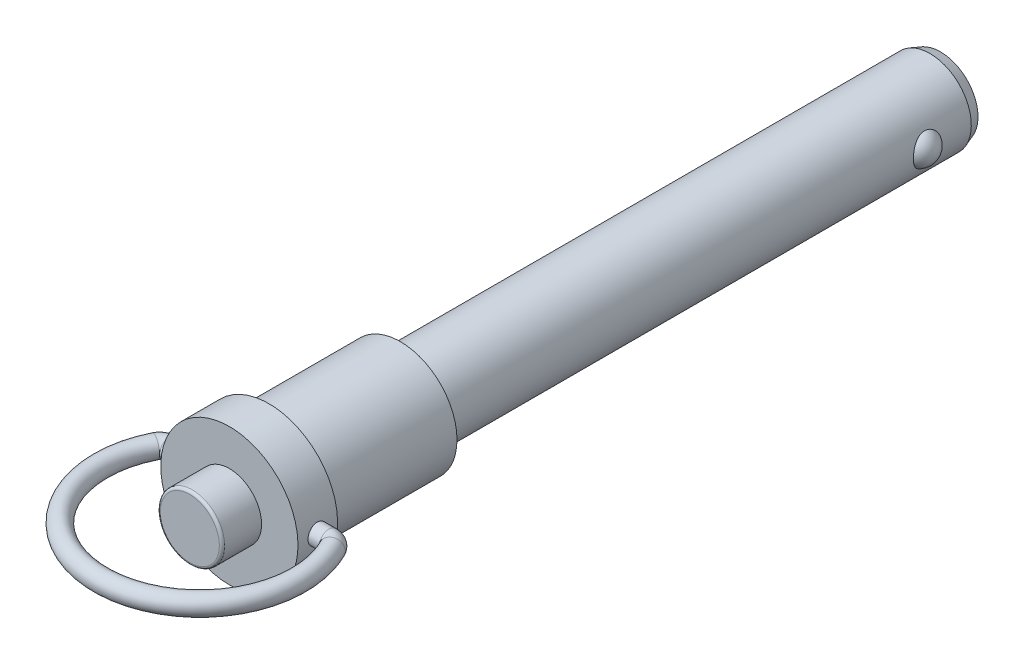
ISO-10303-21;
HEADER;
FILE_DESCRIPTION(('STEP AP214'),'2;1');
FILE_NAME('part.step','',(''),(''),'','','');
FILE_SCHEMA(('AUTOMOTIVE_DESIGN { 1 0 10303 214 1 1 1 1 }'));
ENDSEC;
DATA;
#1=APPLICATION_CONTEXT('core data for automotive mechanical design processes');
#2=APPLICATION_PROTOCOL_DEFINITION('international standard','automotive_design',2000,#1);
#3=PRODUCT_CONTEXT('',#1,'mechanical');
#4=PRODUCT('Part','Part','',(#3));
#5=PRODUCT_RELATED_PRODUCT_CATEGORY('part','',(#4));
#6=PRODUCT_DEFINITION_FORMATION('','',#4);
#7=PRODUCT_DEFINITION_CONTEXT('part definition',#1,'design');
#8=PRODUCT_DEFINITION('design','',#6,#7);
#9=PRODUCT_DEFINITION_SHAPE('','',#8);
#10=(LENGTH_UNIT() NAMED_UNIT(*) SI_UNIT(.MILLI.,.METRE.));
#11=(NAMED_UNIT(*) PLANE_ANGLE_UNIT() SI_UNIT($,.RADIAN.));
#12=(NAMED_UNIT(*) SI_UNIT($,.STERADIAN.) SOLID_ANGLE_UNIT());
#13=UNCERTAINTY_MEASURE_WITH_UNIT(LENGTH_MEASURE(1.E-05),#10,'distance_accuracy_value','');
#14=(GEOMETRIC_REPRESENTATION_CONTEXT(3) GLOBAL_UNCERTAINTY_ASSIGNED_CONTEXT((#13)) GLOBAL_UNIT_ASSIGNED_CONTEXT((#10,
#11,#12)) REPRESENTATION_CONTEXT('',''));
#15=CARTESIAN_POINT('',(0.,0.,0.));
#16=DIRECTION('',(0.,0.,1.));
#17=DIRECTION('',(1.,0.,0.));
#18=AXIS2_PLACEMENT_3D('',#15,#16,#17);
#19=CARTESIAN_POINT('',(-7.23283748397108,0.,-103.9826));
#20=DIRECTION('',(0.,0.,1.));
#21=DIRECTION('',(0.,1.,0.));
#22=AXIS2_PLACEMENT_3D('',#19,#20,#21);
#23=PLANE('',#22);
#24=CARTESIAN_POINT('',(0.,0.,-103.9826));
#25=DIRECTION('',(0.,0.,1.));
#26=DIRECTION('',(0.,1.,0.));
#27=AXIS2_PLACEMENT_3D('',#24,#25,#26);
#28=CIRCLE('',#27,7.23283748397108);
#29=CARTESIAN_POINT('',(0.,7.23283748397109,-103.9826));
#30=VERTEX_POINT('',#29);
#31=EDGE_CURVE('E228',#30,#30,#28,.T.);
#32=ORIENTED_EDGE('',*,*,#31,.F.);
#33=EDGE_LOOP('',(#32));
#34=FACE_BOUND('',#33,.T.);
#35=ADVANCED_FACE('F14',(#34),#23,.F.);
#36=CARTESIAN_POINT('',(6.3254,0.,-93.5178));
#37=DIRECTION('',(0.,0.,1.));
#38=DIRECTION('',(-1.,0.,0.));
#39=AXIS2_PLACEMENT_3D('',#36,#37,#38);
#40=SPHERICAL_SURFACE('',#39,3.175);
#41=CARTESIAN_POINT('',(7.972425,0.,-90.8034062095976));
#42=CARTESIAN_POINT('',(7.97241726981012,0.174963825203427,-90.8034110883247));
#43=CARTESIAN_POINT('',(7.96661031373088,0.350072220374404,-90.8168531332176));
#44=CARTESIAN_POINT('',(7.94391651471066,0.695574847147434,-90.8705412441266));
#45=CARTESIAN_POINT('',(7.92701418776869,0.865962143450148,-90.9108247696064));
#46=CARTESIAN_POINT('',(7.88381094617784,1.19705751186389,-91.0178494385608));
#47=CARTESIAN_POINT('',(7.85750751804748,1.35776298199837,-91.084597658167));
#48=CARTESIAN_POINT('',(7.79828591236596,1.66454963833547,-91.2437588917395));
#49=CARTESIAN_POINT('',(7.7653692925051,1.81063425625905,-91.3361658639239));
#50=CARTESIAN_POINT('',(7.6973220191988,2.08082133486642,-91.5434318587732));
#51=CARTESIAN_POINT('',(7.66224767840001,2.20529978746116,-91.6578132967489));
#52=CARTESIAN_POINT('',(7.61082801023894,2.37452550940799,-91.8452714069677));
#53=CARTESIAN_POINT('',(7.59387880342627,2.42804053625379,-91.9104406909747));
#54=CARTESIAN_POINT('',(7.56094914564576,2.52871559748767,-92.045725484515));
#55=CARTESIAN_POINT('',(7.54496815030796,2.57587922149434,-92.115838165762));
#56=CARTESIAN_POINT('',(7.51569590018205,2.66002101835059,-92.2550958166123));
#57=CARTESIAN_POINT('',(7.50229271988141,2.69749875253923,-92.3239160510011));
#58=CARTESIAN_POINT('',(7.47725403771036,2.76614659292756,-92.4649044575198));
#59=CARTESIAN_POINT('',(7.46561758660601,2.79732008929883,-92.5370708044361));
#60=CARTESIAN_POINT('',(7.44451748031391,2.85299970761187,-92.6841997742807));
#61=CARTESIAN_POINT('',(7.43505273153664,2.87750918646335,-92.7591609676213));
#62=CARTESIAN_POINT('',(7.41863811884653,2.91956849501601,-92.9112788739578));
#63=CARTESIAN_POINT('',(7.41168797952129,2.93711908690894,-92.9884353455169));
#64=CARTESIAN_POINT('',(7.40116212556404,2.96353478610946,-93.1359046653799));
#65=CARTESIAN_POINT('',(7.39730521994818,2.97312751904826,-93.2060679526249));
#66=CARTESIAN_POINT('',(7.39192783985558,2.98647205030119,-93.3470623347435));
#67=CARTESIAN_POINT('',(7.39040812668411,2.99022194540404,-93.4178936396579));
#68=CARTESIAN_POINT('',(7.38975833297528,2.99182794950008,-93.5595897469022));
#69=CARTESIAN_POINT('',(7.39062662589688,2.98968807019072,-93.6304544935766));
#70=CARTESIAN_POINT('',(7.39471686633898,2.97955470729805,-93.7717034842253));
#71=CARTESIAN_POINT('',(7.39793967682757,2.97155907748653,-93.8420875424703));
#72=CARTESIAN_POINT('',(7.41052697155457,2.94009947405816,-94.043919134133));
#73=CARTESIAN_POINT('',(7.42280379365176,2.90920494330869,-94.1741115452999));
#74=CARTESIAN_POINT('',(7.4541314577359,2.82795803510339,-94.4273054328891));
#75=CARTESIAN_POINT('',(7.47318306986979,2.7776034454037,-94.5503060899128));
#76=CARTESIAN_POINT('',(7.51696016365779,2.65690222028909,-94.7909708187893));
#77=CARTESIAN_POINT('',(7.5418730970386,2.58587106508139,-94.9082567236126));
#78=CARTESIAN_POINT('',(7.59450635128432,2.426938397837,-95.1300314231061));
#79=CARTESIAN_POINT('',(7.62222751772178,2.33903179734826,-95.234516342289));
#80=CARTESIAN_POINT('',(7.68069620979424,2.13967899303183,-95.4383986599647));
#81=CARTESIAN_POINT('',(7.71148158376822,2.0267915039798,-95.5363756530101));
#82=CARTESIAN_POINT('',(7.77061509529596,1.78672707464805,-95.7138815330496));
#83=CARTESIAN_POINT('',(7.79896157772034,1.65954056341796,-95.7933979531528));
#84=CARTESIAN_POINT('',(7.85313577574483,1.38188004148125,-95.9395063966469));
#85=CARTESIAN_POINT('',(7.87849512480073,1.23034006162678,-96.0042480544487));
#86=CARTESIAN_POINT('',(7.92093083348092,0.918236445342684,-96.1099613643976));
#87=CARTESIAN_POINT('',(7.9380155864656,0.757682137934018,-96.1509571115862));
#88=CARTESIAN_POINT('',(7.95754077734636,0.496793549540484,-96.1973352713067));
#89=CARTESIAN_POINT('',(7.96310427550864,0.397984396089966,-96.2104005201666));
#90=CARTESIAN_POINT('',(7.97054862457,0.199465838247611,-96.2278312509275));
#91=CARTESIAN_POINT('',(7.97242940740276,0.0997564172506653,-96.2321965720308));
#92=CARTESIAN_POINT('',(7.97241726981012,-0.174963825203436,-96.2321889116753));
#93=CARTESIAN_POINT('',(7.96661031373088,-0.350072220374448,-96.2187468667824));
#94=CARTESIAN_POINT('',(7.94391651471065,-0.695574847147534,-96.1650587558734));
#95=CARTESIAN_POINT('',(7.92701418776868,-0.865962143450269,-96.1247752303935));
#96=CARTESIAN_POINT('',(7.88381094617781,-1.19705751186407,-96.0177505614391));
#97=CARTESIAN_POINT('',(7.85750751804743,-1.35776298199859,-95.9510023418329));
#98=CARTESIAN_POINT('',(7.79828591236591,-1.66454963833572,-95.7918411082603));
#99=CARTESIAN_POINT('',(7.76536929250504,-1.8106342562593,-95.6994341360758));
#100=CARTESIAN_POINT('',(7.69732201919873,-2.08082133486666,-95.4921681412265));
#101=CARTESIAN_POINT('',(7.66224767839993,-2.20529978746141,-95.3777867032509));
#102=CARTESIAN_POINT('',(7.61082801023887,-2.37452550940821,-95.190328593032));
#103=CARTESIAN_POINT('',(7.5938788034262,-2.42804053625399,-95.125159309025));
#104=CARTESIAN_POINT('',(7.5609491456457,-2.52871559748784,-94.9898745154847));
#105=CARTESIAN_POINT('',(7.54496815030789,-2.57587922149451,-94.9197618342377));
#106=CARTESIAN_POINT('',(7.51569590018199,-2.66002101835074,-94.7805041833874));
#107=CARTESIAN_POINT('',(7.50229271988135,-2.69749875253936,-94.7116839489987));
#108=CARTESIAN_POINT('',(7.47725403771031,-2.76614659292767,-94.5706955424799));
#109=CARTESIAN_POINT('',(7.46561758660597,-2.79732008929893,-94.4985291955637));
#110=CARTESIAN_POINT('',(7.44451748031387,-2.85299970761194,-94.351400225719));
#111=CARTESIAN_POINT('',(7.43505273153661,-2.87750918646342,-94.2764390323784));
#112=CARTESIAN_POINT('',(7.41863811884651,-2.91956849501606,-94.1243211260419));
#113=CARTESIAN_POINT('',(7.41168797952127,-2.93711908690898,-94.0471646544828));
#114=CARTESIAN_POINT('',(7.40116212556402,-2.96353478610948,-93.8996953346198));
#115=CARTESIAN_POINT('',(7.39730521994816,-2.97312751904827,-93.8295320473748));
#116=CARTESIAN_POINT('',(7.39192783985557,-2.98647205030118,-93.6885376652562));
#117=CARTESIAN_POINT('',(7.3904081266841,-2.99022194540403,-93.6177063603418));
#118=CARTESIAN_POINT('',(7.38975833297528,-2.99182794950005,-93.4760102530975));
#119=CARTESIAN_POINT('',(7.39062662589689,-2.98968807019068,-93.4051455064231));
#120=CARTESIAN_POINT('',(7.39471686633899,-2.97955470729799,-93.2638965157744));
#121=CARTESIAN_POINT('',(7.39793967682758,-2.97155907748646,-93.1935124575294));
#122=CARTESIAN_POINT('',(7.41052697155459,-2.94009947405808,-92.9916808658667));
#123=CARTESIAN_POINT('',(7.42280379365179,-2.90920494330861,-92.8614884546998));
#124=CARTESIAN_POINT('',(7.45413145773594,-2.82795803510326,-92.6082945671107));
#125=CARTESIAN_POINT('',(7.47318306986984,-2.77760344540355,-92.485293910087));
#126=CARTESIAN_POINT('',(7.51696016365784,-2.65690222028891,-92.2446291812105));
#127=CARTESIAN_POINT('',(7.54187309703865,-2.58587106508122,-92.1273432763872));
#128=CARTESIAN_POINT('',(7.59450635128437,-2.42693839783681,-91.9055685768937));
#129=CARTESIAN_POINT('',(7.62222751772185,-2.33903179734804,-91.8010836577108));
#130=CARTESIAN_POINT('',(7.68069620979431,-2.13967899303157,-91.5972013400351));
#131=CARTESIAN_POINT('',(7.71148158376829,-2.02679150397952,-91.4992243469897));
#132=CARTESIAN_POINT('',(7.77061509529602,-1.78672707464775,-91.3217184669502));
#133=CARTESIAN_POINT('',(7.7989615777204,-1.65954056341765,-91.242202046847));
#134=CARTESIAN_POINT('',(7.85313577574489,-1.38188004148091,-91.0960936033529));
#135=CARTESIAN_POINT('',(7.87849512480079,-1.23034006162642,-91.0313519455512));
#136=CARTESIAN_POINT('',(7.92093083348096,-0.918236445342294,-90.9256386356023));
#137=CARTESIAN_POINT('',(7.93801558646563,-0.757682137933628,-90.8846428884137));
#138=CARTESIAN_POINT('',(7.95754077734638,-0.496793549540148,-90.8382647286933));
#139=CARTESIAN_POINT('',(7.96310427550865,-0.39798439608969,-90.8251994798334));
#140=CARTESIAN_POINT('',(7.97054862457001,-0.199465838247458,-90.8077687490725));
#141=CARTESIAN_POINT('',(7.97242940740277,-0.0997564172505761,-90.8034034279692));
#142=CARTESIAN_POINT('',(7.972425,0.,-90.8034062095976));
#143=B_SPLINE_CURVE_WITH_KNOTS('',3,(#41,#42,#43,#44,#45,#46,#47,#48,#49,#50,#51,#52,#53,#54,
#55,#56,#57,#58,#59,#60,#61,#62,#63,#64,#65,#66,#67,#68,#69,#70,#71,#72,#73,#74,#75,#76,#77,#78,
#79,#80,#81,#82,#83,#84,#85,#86,#87,#88,#89,#90,#91,#92,#93,#94,#95,#96,#97,#98,#99,#100,#101,
#102,#103,#104,#105,#106,#107,#108,#109,#110,#111,#112,#113,#114,#115,#116,#117,#118,#119,#120,
#121,#122,#123,#124,#125,#126,#127,#128,#129,#130,#131,#132,#133,#134,#135,#136,#137,#138,#139,
#140,#141,#142),.UNSPECIFIED.,.T.,.F.,(4,2,2,2,2,2,2,2,2,2,2,2,2,2,2,2,2,2,2,2,2,2,2,2,2,2,2,2,
2,2,2,2,2,2,2,2,2,2,2,2,2,2,2,2,2,2,2,2,2,2,4),(0.,0.52453249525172,1.04979855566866,
1.57520515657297,2.10048814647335,2.61543479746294,2.87315909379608,3.13073711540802,
3.36891793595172,3.60697032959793,3.84490258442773,4.0828087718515,4.29529683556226,
4.5078540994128,4.72026662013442,4.93275703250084,5.33386765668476,5.73502389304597,
6.15136290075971,6.56782764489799,7.02375816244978,7.4799956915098,7.97801301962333,
8.47552411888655,8.77458316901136,9.07364774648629,9.59818024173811,10.1234463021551,
10.6488529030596,11.17413589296,11.6890825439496,11.9468068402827,12.2043848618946,
12.4425656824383,12.6806180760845,12.9185503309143,13.1564565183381,13.3689445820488,
13.5815018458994,13.793914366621,14.0064047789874,14.4075154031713,14.8086716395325,
15.2250106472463,15.6414753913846,16.0974059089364,16.5536434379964,17.05166076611,
17.5491718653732,17.8482309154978,18.1472954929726),.UNSPECIFIED.);
#144=CARTESIAN_POINT('',(7.972425,0.,-90.8034062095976));
#145=VERTEX_POINT('',#144);
#146=EDGE_CURVE('E221',#145,#145,#143,.T.);
#147=ORIENTED_EDGE('',*,*,#146,.F.);
#148=EDGE_LOOP('',(#147));
#149=FACE_BOUND('',#148,.T.);
#150=ADVANCED_FACE('F229',(#149),#40,.T.);
#151=CARTESIAN_POINT('',(-6.3246,0.,-93.5178));
#152=DIRECTION('',(0.,0.,1.));
#153=DIRECTION('',(-1.,0.,0.));
#154=AXIS2_PLACEMENT_3D('',#151,#152,#153);
#155=SPHERICAL_SURFACE('',#154,3.175);
#156=CARTESIAN_POINT('',(-7.972425,0.,-96.2317082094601));
#157=CARTESIAN_POINT('',(-7.97241727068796,0.174952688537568,-96.2317033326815));
#158=CARTESIAN_POINT('',(-7.96661105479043,0.350049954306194,-96.2182623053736));
#159=CARTESIAN_POINT('',(-7.94392013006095,0.695530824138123,-96.1645780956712));
#160=CARTESIAN_POINT('',(-7.92701993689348,0.865907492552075,-96.1242974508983));
#161=CARTESIAN_POINT('',(-7.88382210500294,1.1969825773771,-96.0172798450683));
#162=CARTESIAN_POINT('',(-7.85752194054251,1.35767837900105,-95.950535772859));
#163=CARTESIAN_POINT('',(-7.79830777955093,1.66444625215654,-95.7913834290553));
#164=CARTESIAN_POINT('',(-7.76539534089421,1.81052175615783,-95.6989812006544));
#165=CARTESIAN_POINT('',(-7.69735815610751,2.08068673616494,-95.4917274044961));
#166=CARTESIAN_POINT('',(-7.66228978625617,2.20515274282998,-95.3773541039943));
#167=CARTESIAN_POINT('',(-7.61087967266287,2.37435974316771,-95.1899087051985));
#168=CARTESIAN_POINT('',(-7.593933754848,2.42786851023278,-95.124743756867));
#169=CARTESIAN_POINT('',(-7.5610108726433,2.52853087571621,-94.9894677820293));
#170=CARTESIAN_POINT('',(-7.54503336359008,2.57568806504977,-94.9193595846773));
#171=CARTESIAN_POINT('',(-7.515769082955,2.6598140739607,-94.7801158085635));
#172=CARTESIAN_POINT('',(-7.5023702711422,2.69728292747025,-94.7113052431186));
#173=CARTESIAN_POINT('',(-7.47734019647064,2.76591355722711,-94.5703368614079));
#174=CARTESIAN_POINT('',(-7.46570798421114,2.79707872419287,-94.4981808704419));
#175=CARTESIAN_POINT('',(-7.44461613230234,2.85274218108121,-94.3510733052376));
#176=CARTESIAN_POINT('',(-7.43515539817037,2.87724383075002,-94.2761231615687));
#177=CARTESIAN_POINT('',(-7.41874848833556,2.91928796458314,-94.1240280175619));
#178=CARTESIAN_POINT('',(-7.41180203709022,2.9368312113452,-94.0468832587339));
#179=CARTESIAN_POINT('',(-7.40128307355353,2.96323267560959,-93.8994411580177));
#180=CARTESIAN_POINT('',(-7.39742927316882,2.97281883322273,-93.829293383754));
#181=CARTESIAN_POINT('',(-7.3920573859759,2.98615137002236,-93.6883306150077));
#182=CARTESIAN_POINT('',(-7.39054006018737,2.98989584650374,-93.6175154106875));
#183=CARTESIAN_POINT('',(-7.38989424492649,2.99149222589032,-93.4758519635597));
#184=CARTESIAN_POINT('',(-7.39076412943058,2.9893481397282,-93.4050037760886));
#185=CARTESIAN_POINT('',(-7.39485671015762,2.97920762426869,-93.2637882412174));
#186=CARTESIAN_POINT('',(-7.39808026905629,2.97120904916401,-93.1934210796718));
#187=CARTESIAN_POINT('',(-7.41066840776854,2.93974298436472,-92.9916394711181));
#188=CARTESIAN_POINT('',(-7.42294415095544,2.90884676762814,-92.8614803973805));
#189=CARTESIAN_POINT('',(-7.45426659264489,2.82760178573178,-92.6083526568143));
#190=CARTESIAN_POINT('',(-7.4733140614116,2.77725080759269,-92.4853848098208));
#191=CARTESIAN_POINT('',(-7.51708080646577,2.65656071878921,-92.2447817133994));
#192=CARTESIAN_POINT('',(-7.5419875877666,2.58553675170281,-92.1275248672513));
#193=CARTESIAN_POINT('',(-7.59460690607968,2.42662332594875,-91.9058059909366));
#194=CARTESIAN_POINT('',(-7.62232028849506,2.33872877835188,-91.80134783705));
#195=CARTESIAN_POINT('',(-7.68077324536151,2.13940178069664,-91.5975136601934));
#196=CARTESIAN_POINT('',(-7.71155061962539,2.02652778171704,-91.4995584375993));
#197=CARTESIAN_POINT('',(-7.77066832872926,1.78649437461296,-91.3220926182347));
#198=CARTESIAN_POINT('',(-7.79900700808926,1.65932539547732,-91.2425944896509));
#199=CARTESIAN_POINT('',(-7.85316757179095,1.3816977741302,-91.0965158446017));
#200=CARTESIAN_POINT('',(-7.87852090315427,1.23017281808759,-91.0317864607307));
#201=CARTESIAN_POINT('',(-7.92094613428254,0.91810159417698,-90.9260941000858));
#202=CARTESIAN_POINT('',(-7.93802642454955,0.757564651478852,-90.8851070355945));
#203=CARTESIAN_POINT('',(-7.95754577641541,0.496710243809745,-90.8387404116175));
#204=CARTESIAN_POINT('',(-7.96310740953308,0.397917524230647,-90.8256788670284));
#205=CARTESIAN_POINT('',(-7.97054925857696,0.199432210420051,-90.8082530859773));
#206=CARTESIAN_POINT('',(-7.97242940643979,0.0997395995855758,-90.8038890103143));
#207=CARTESIAN_POINT('',(-7.97241727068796,-0.174952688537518,-90.8038966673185));
#208=CARTESIAN_POINT('',(-7.96661105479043,-0.350049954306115,-90.8173376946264));
#209=CARTESIAN_POINT('',(-7.94392013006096,-0.695530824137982,-90.8710219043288));
#210=CARTESIAN_POINT('',(-7.92701993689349,-0.865907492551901,-90.9113025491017));
#211=CARTESIAN_POINT('',(-7.88382210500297,-1.19698257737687,-91.0183201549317));
#212=CARTESIAN_POINT('',(-7.85752194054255,-1.35767837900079,-91.0850642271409));
#213=CARTESIAN_POINT('',(-7.79830777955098,-1.66444625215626,-91.2442165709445));
#214=CARTESIAN_POINT('',(-7.76539534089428,-1.81052175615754,-91.3366187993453));
#215=CARTESIAN_POINT('',(-7.6973581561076,-2.08068673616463,-91.5438725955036));
#216=CARTESIAN_POINT('',(-7.66228978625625,-2.20515274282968,-91.6582458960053));
#217=CARTESIAN_POINT('',(-7.61087967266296,-2.37435974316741,-91.8456912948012));
#218=CARTESIAN_POINT('',(-7.59393375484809,-2.42786851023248,-91.9108562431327));
#219=CARTESIAN_POINT('',(-7.56101087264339,-2.52853087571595,-92.0461322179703));
#220=CARTESIAN_POINT('',(-7.54503336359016,-2.57568806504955,-92.1162404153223));
#221=CARTESIAN_POINT('',(-7.51576908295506,-2.65981407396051,-92.2554841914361));
#222=CARTESIAN_POINT('',(-7.50237027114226,-2.69728292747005,-92.324294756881));
#223=CARTESIAN_POINT('',(-7.47734019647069,-2.76591355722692,-92.4652631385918));
#224=CARTESIAN_POINT('',(-7.4657079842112,-2.7970787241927,-92.5374191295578));
#225=CARTESIAN_POINT('',(-7.44461613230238,-2.85274218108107,-92.6845266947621));
#226=CARTESIAN_POINT('',(-7.4351553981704,-2.87724383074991,-92.7594768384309));
#227=CARTESIAN_POINT('',(-7.41874848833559,-2.91928796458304,-92.9115719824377));
#228=CARTESIAN_POINT('',(-7.41180203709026,-2.9368312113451,-92.9887167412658));
#229=CARTESIAN_POINT('',(-7.40128307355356,-2.96323267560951,-93.136158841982));
#230=CARTESIAN_POINT('',(-7.39742927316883,-2.97281883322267,-93.2063066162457));
#231=CARTESIAN_POINT('',(-7.3920573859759,-2.98615137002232,-93.347269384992));
#232=CARTESIAN_POINT('',(-7.39054006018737,-2.98989584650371,-93.4180845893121));
#233=CARTESIAN_POINT('',(-7.38989424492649,-2.99149222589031,-93.55974803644));
#234=CARTESIAN_POINT('',(-7.39076412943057,-2.98934813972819,-93.6305962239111));
#235=CARTESIAN_POINT('',(-7.3948567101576,-2.9792076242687,-93.7718117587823));
#236=CARTESIAN_POINT('',(-7.39808026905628,-2.97120904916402,-93.8421789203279));
#237=CARTESIAN_POINT('',(-7.41066840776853,-2.93974298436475,-94.0439605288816));
#238=CARTESIAN_POINT('',(-7.42294415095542,-2.90884676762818,-94.1741196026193));
#239=CARTESIAN_POINT('',(-7.45426659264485,-2.82760178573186,-94.4272473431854));
#240=CARTESIAN_POINT('',(-7.47331406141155,-2.77725080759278,-94.550215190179));
#241=CARTESIAN_POINT('',(-7.51708080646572,-2.65656071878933,-94.7908182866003));
#242=CARTESIAN_POINT('',(-7.54198758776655,-2.58553675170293,-94.9080751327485));
#243=CARTESIAN_POINT('',(-7.59460690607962,-2.42662332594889,-95.1297940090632));
#244=CARTESIAN_POINT('',(-7.62232028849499,-2.33872877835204,-95.2342521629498));
#245=CARTESIAN_POINT('',(-7.68077324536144,-2.13940178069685,-95.4380863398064));
#246=CARTESIAN_POINT('',(-7.71155061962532,-2.02652778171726,-95.5360415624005));
#247=CARTESIAN_POINT('',(-7.7706683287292,-1.78649437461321,-95.7135073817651));
#248=CARTESIAN_POINT('',(-7.7990070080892,-1.65932539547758,-95.7930055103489));
#249=CARTESIAN_POINT('',(-7.8531675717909,-1.38169777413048,-95.9390841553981));
#250=CARTESIAN_POINT('',(-7.87852090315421,-1.2301728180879,-96.0038135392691));
#251=CARTESIAN_POINT('',(-7.9209461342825,-0.918101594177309,-96.1095058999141));
#252=CARTESIAN_POINT('',(-7.93802642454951,-0.757564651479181,-96.1504929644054));
#253=CARTESIAN_POINT('',(-7.95754577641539,-0.496710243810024,-96.1968595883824));
#254=CARTESIAN_POINT('',(-7.96310740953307,-0.39791752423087,-96.2099211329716));
#255=CARTESIAN_POINT('',(-7.97054925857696,-0.199432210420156,-96.2273469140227));
#256=CARTESIAN_POINT('',(-7.97242940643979,-0.0997395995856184,-96.2317109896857));
#257=CARTESIAN_POINT('',(-7.972425,0.,-96.2317082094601));
#258=B_SPLINE_CURVE_WITH_KNOTS('',3,(#156,#157,#158,#159,#160,#161,#162,#163,#164,#165,#166,
#167,#168,#169,#170,#171,#172,#173,#174,#175,#176,#177,#178,#179,#180,#181,#182,#183,#184,#185,
#186,#187,#188,#189,#190,#191,#192,#193,#194,#195,#196,#197,#198,#199,#200,#201,#202,#203,#204,
#205,#206,#207,#208,#209,#210,#211,#212,#213,#214,#215,#216,#217,#218,#219,#220,#221,#222,#223,
#224,#225,#226,#227,#228,#229,#230,#231,#232,#233,#234,#235,#236,#237,#238,#239,#240,#241,#242,
#243,#244,#245,#246,#247,#248,#249,#250,#251,#252,#253,#254,#255,#256,#257),.UNSPECIFIED.,.T.,
.F.,(4,2,2,2,2,2,2,2,2,2,2,2,2,2,2,2,2,2,2,2,2,2,2,2,2,2,2,2,2,2,2,2,2,2,2,2,2,2,2,2,2,2,2,2,2,
2,2,2,2,2,4),(0.,0.524499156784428,1.04973194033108,1.57510595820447,2.10035634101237,
2.615256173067,2.87295695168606,3.13051142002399,3.36865238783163,3.60666491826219,
3.84455721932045,4.08242344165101,4.29486234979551,4.50737043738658,4.71973381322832,
4.93217506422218,5.33319020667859,5.73425097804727,6.15050279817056,6.5668803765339,
7.02273464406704,7.47889596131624,7.97685568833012,8.47430932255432,8.77331798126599,
9.07233216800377,9.5968313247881,10.1220641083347,10.6474381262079,11.1726885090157,
11.6875883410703,11.9452891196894,12.2028435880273,12.440984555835,12.6789970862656,
12.9168893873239,13.1547556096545,13.367194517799,13.57970260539,13.7920659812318,
14.0045072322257,14.4055223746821,14.8065831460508,15.2228349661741,15.6392125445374,
16.0950668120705,16.5512281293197,17.0491878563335,17.5466414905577,17.8456501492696,
18.1446643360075),.UNSPECIFIED.);
#259=CARTESIAN_POINT('',(-7.972425,0.,-96.2317082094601));
#260=VERTEX_POINT('',#259);
#261=EDGE_CURVE('E25',#260,#260,#258,.T.);
#262=ORIENTED_EDGE('',*,*,#261,.F.);
#263=EDGE_LOOP('',(#262));
#264=FACE_BOUND('',#263,.T.);
#265=ADVANCED_FACE('F209',(#264),#155,.T.);
#266=CARTESIAN_POINT('',(0.,0.,-101.9506));
#267=DIRECTION('',(0.,0.,1.));
#268=DIRECTION('',(0.,1.,0.));
#269=AXIS2_PLACEMENT_3D('',#266,#267,#268);
#270=CONICAL_SURFACE('',#269,7.972425,0.349065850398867);
#271=CARTESIAN_POINT('',(0.,0.,-101.9506));
#272=DIRECTION('',(0.,0.,1.));
#273=DIRECTION('',(0.,1.,0.));
#274=AXIS2_PLACEMENT_3D('',#271,#272,#273);
#275=CIRCLE('',#274,7.972425);
#276=CARTESIAN_POINT('',(0.,7.97242500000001,-101.9506));
#277=VERTEX_POINT('',#276);
#278=EDGE_CURVE('E9',#277,#277,#275,.T.);
#279=ORIENTED_EDGE('',*,*,#278,.F.);
#280=EDGE_LOOP('',(#279));
#281=FACE_BOUND('',#280,.T.);
#282=ORIENTED_EDGE('',*,*,#31,.T.);
#283=EDGE_LOOP('',(#282));
#284=FACE_BOUND('',#283,.T.);
#285=ADVANCED_FACE('F203',(#281,#284),#270,.T.);
#286=CARTESIAN_POINT('',(0.,0.,-40.));
#287=DIRECTION('',(0.,0.,1.));
#288=DIRECTION('',(0.,1.,0.));
#289=AXIS2_PLACEMENT_3D('',#286,#287,#288);
#290=CYLINDRICAL_SURFACE('',#289,7.972425);
#291=ORIENTED_EDGE('',*,*,#278,.T.);
#292=EDGE_LOOP('',(#291));
#293=FACE_BOUND('',#292,.T.);
#294=ORIENTED_EDGE('',*,*,#261,.T.);
#295=EDGE_LOOP('',(#294));
#296=FACE_BOUND('',#295,.T.);
#297=ORIENTED_EDGE('',*,*,#146,.T.);
#298=EDGE_LOOP('',(#297));
#299=FACE_BOUND('',#298,.T.);
#300=CARTESIAN_POINT('',(0.,0.,0.));
#301=DIRECTION('',(0.,0.,-1.));
#302=DIRECTION('',(0.,1.,0.));
#303=AXIS2_PLACEMENT_3D('',#300,#301,#302);
#304=CIRCLE('',#303,7.972425);
#305=CARTESIAN_POINT('',(0.,7.972425,0.));
#306=VERTEX_POINT('',#305);
#307=EDGE_CURVE('E239',#306,#306,#304,.F.);
#308=ORIENTED_EDGE('',*,*,#307,.F.);
#309=EDGE_LOOP('',(#308));
#310=FACE_BOUND('',#309,.T.);
#311=ADVANCED_FACE('F63',(#293,#296,#299,#310),#290,.T.);
#312=CARTESIAN_POINT('',(0.,0.,40.545));
#313=DIRECTION('',(0.,0.,1.));
#314=DIRECTION('',(0.,1.,0.));
#315=AXIS2_PLACEMENT_3D('',#312,#313,#314);
#316=PLANE('',#315);
#317=CARTESIAN_POINT('',(0.,0.,40.545));
#318=DIRECTION('',(0.,0.,-1.));
#319=DIRECTION('',(0.,-1.,0.));
#320=AXIS2_PLACEMENT_3D('',#317,#318,#319);
#321=CIRCLE('',#320,5.6896);
#322=CARTESIAN_POINT('',(0.,-5.6896,40.545));
#323=VERTEX_POINT('',#322);
#324=CARTESIAN_POINT('',(0.,5.6896,40.545));
#325=VERTEX_POINT('',#324);
#326=EDGE_CURVE('E38',#323,#325,#321,.T.);
#327=ORIENTED_EDGE('',*,*,#326,.F.);
#328=CARTESIAN_POINT('',(0.,0.,40.545));
#329=DIRECTION('',(0.,0.,-1.));
#330=DIRECTION('',(0.,1.,0.));
#331=AXIS2_PLACEMENT_3D('',#328,#329,#330);
#332=CIRCLE('',#331,5.6896);
#333=EDGE_CURVE('E32',#325,#323,#332,.T.);
#334=ORIENTED_EDGE('',*,*,#333,.F.);
#335=EDGE_LOOP('',(#327,#334));
#336=FACE_BOUND('',#335,.T.);
#337=ADVANCED_FACE('F43',(#336),#316,.T.);
#338=CARTESIAN_POINT('',(0.,0.,38.64));
#339=DIRECTION('',(0.,1.,0.));
#340=DIRECTION('',(-1.,0.,0.));
#341=AXIS2_PLACEMENT_3D('',#338,#339,#340);
#342=TOROIDAL_SURFACE('',#341,19.05,1.8796);
#343=CARTESIAN_POINT('',(-17.0651122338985,0.,30.1733333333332));
#344=DIRECTION('',(-0.44444444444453,0.,0.895806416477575));
#345=DIRECTION('',(-0.895806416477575,0.,-0.44444444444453));
#346=AXIS2_PLACEMENT_3D('',#343,#344,#345);
#347=CIRCLE('',#346,1.8796);
#348=CARTESIAN_POINT('',(-18.7488699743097,0.,29.3379555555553));
#349=VERTEX_POINT('',#348);
#350=EDGE_CURVE('E107',#349,#349,#347,.F.);
#351=ORIENTED_EDGE('',*,*,#350,.F.);
#352=EDGE_LOOP('',(#351));
#353=FACE_BOUND('',#352,.T.);
#354=CARTESIAN_POINT('',(17.0651122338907,0.,30.1733333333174));
#355=DIRECTION('',(-0.444444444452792,0.,-0.895806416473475));
#356=DIRECTION('',(0.895806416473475,0.,-0.444444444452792));
#357=AXIS2_PLACEMENT_3D('',#354,#355,#356);
#358=CIRCLE('',#357,1.8796);
#359=CARTESIAN_POINT('',(18.7488699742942,0.,29.3379555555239));
#360=VERTEX_POINT('',#359);
#361=EDGE_CURVE('E104',#360,#360,#358,.T.);
#362=ORIENTED_EDGE('',*,*,#361,.F.);
#363=EDGE_LOOP('',(#362));
#364=FACE_BOUND('',#363,.T.);
#365=ADVANCED_FACE('F62',(#353,#364),#342,.T.);
#366=CARTESIAN_POINT('',(0.,0.,40.037));
#367=DIRECTION('',(0.,0.,1.));
#368=DIRECTION('',(0.,1.,0.));
#369=AXIS2_PLACEMENT_3D('',#366,#367,#368);
#370=TOROIDAL_SURFACE('',#369,5.6896,0.508);
#371=ORIENTED_EDGE('',*,*,#333,.T.);
#372=ORIENTED_EDGE('',*,*,#326,.T.);
#373=EDGE_LOOP('',(#371,#372));
#374=FACE_BOUND('',#373,.T.);
#375=CARTESIAN_POINT('',(0.,0.,40.037));
#376=DIRECTION('',(0.,0.,-1.));
#377=DIRECTION('',(0.,-1.,0.));
#378=AXIS2_PLACEMENT_3D('',#375,#376,#377);
#379=CIRCLE('',#378,6.1976);
#380=CARTESIAN_POINT('',(0.,-6.1976,40.037));
#381=VERTEX_POINT('',#380);
#382=EDGE_CURVE('E81',#381,#381,#379,.T.);
#383=ORIENTED_EDGE('',*,*,#382,.F.);
#384=EDGE_LOOP('',(#383));
#385=FACE_BOUND('',#384,.T.);
#386=ADVANCED_FACE('F36',(#374,#385),#370,.T.);
#387=CARTESIAN_POINT('',(-15.3586010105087,0.,31.02));
#388=DIRECTION('',(0.,1.,0.));
#389=DIRECTION('',(-1.,0.,0.));
#390=AXIS2_PLACEMENT_3D('',#387,#388,#389);
#391=TOROIDAL_SURFACE('',#390,1.905,1.8796);
#392=CARTESIAN_POINT('',(-15.3586010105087,0.,29.115));
#393=DIRECTION('',(1.,0.,0.));
#394=DIRECTION('',(0.,0.,-1.));
#395=AXIS2_PLACEMENT_3D('',#392,#393,#394);
#396=CIRCLE('',#395,1.8796);
#397=CARTESIAN_POINT('',(-15.3586010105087,0.,27.2354));
#398=VERTEX_POINT('',#397);
#399=EDGE_CURVE('E40',#398,#398,#396,.T.);
#400=ORIENTED_EDGE('',*,*,#399,.F.);
#401=EDGE_LOOP('',(#400));
#402=FACE_BOUND('',#401,.T.);
#403=ORIENTED_EDGE('',*,*,#350,.T.);
#404=EDGE_LOOP('',(#403));
#405=FACE_BOUND('',#404,.T.);
#406=ADVANCED_FACE('F64',(#402,#405),#391,.T.);
#407=CARTESIAN_POINT('',(15.3586010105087,0.,31.02));
#408=DIRECTION('',(0.,1.,0.));
#409=DIRECTION('',(-1.,0.,0.));
#410=AXIS2_PLACEMENT_3D('',#407,#408,#409);
#411=TOROIDAL_SURFACE('',#410,1.90500000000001,1.8796);
#412=CARTESIAN_POINT('',(15.3586010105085,0.,29.115));
#413=DIRECTION('',(1.,0.,0.));
#414=DIRECTION('',(0.,0.,-1.));
#415=AXIS2_PLACEMENT_3D('',#412,#413,#414);
#416=CIRCLE('',#415,1.8796);
#417=CARTESIAN_POINT('',(15.3586010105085,0.,27.2354));
#418=VERTEX_POINT('',#417);
#419=EDGE_CURVE('E44',#418,#418,#416,.F.);
#420=ORIENTED_EDGE('',*,*,#419,.F.);
#421=EDGE_LOOP('',(#420));
#422=FACE_BOUND('',#421,.T.);
#423=ORIENTED_EDGE('',*,*,#361,.T.);
#424=EDGE_LOOP('',(#423));
#425=FACE_BOUND('',#424,.T.);
#426=ADVANCED_FACE('F66',(#422,#425),#411,.T.);
#427=CARTESIAN_POINT('',(0.,0.,40.545));
#428=DIRECTION('',(0.,0.,-1.));
#429=DIRECTION('',(0.,-1.,0.));
#430=AXIS2_PLACEMENT_3D('',#427,#428,#429);
#431=CYLINDRICAL_SURFACE('',#430,6.1976);
#432=CARTESIAN_POINT('',(0.,0.,32.925));
#433=DIRECTION('',(0.,0.,-1.));
#434=DIRECTION('',(0.,-1.,0.));
#435=AXIS2_PLACEMENT_3D('',#432,#433,#434);
#436=CIRCLE('',#435,6.1976);
#437=CARTESIAN_POINT('',(0.,-6.1976,32.925));
#438=VERTEX_POINT('',#437);
#439=EDGE_CURVE('E117',#438,#438,#436,.T.);
#440=ORIENTED_EDGE('',*,*,#439,.F.);
#441=EDGE_LOOP('',(#440));
#442=FACE_BOUND('',#441,.T.);
#443=ORIENTED_EDGE('',*,*,#382,.T.);
#444=EDGE_LOOP('',(#443));
#445=FACE_BOUND('',#444,.T.);
#446=ADVANCED_FACE('F86',(#442,#445),#431,.T.);
#447=CARTESIAN_POINT('',(-15.3586010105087,0.,29.115));
#448=DIRECTION('',(1.,0.,0.));
#449=DIRECTION('',(0.,0.,-1.));
#450=AXIS2_PLACEMENT_3D('',#447,#448,#449);
#451=CYLINDRICAL_SURFACE('',#450,1.8796);
#452=CARTESIAN_POINT('',(-13.208,0.,27.2354));
#453=CARTESIAN_POINT('',(-13.2079983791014,0.105008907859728,27.235404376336));
#454=CARTESIAN_POINT('',(-13.2067345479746,0.210080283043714,27.2442296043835));
#455=CARTESIAN_POINT('',(-13.2018144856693,0.41729041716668,27.2792908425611));
#456=CARTESIAN_POINT('',(-13.1981558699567,0.519426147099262,27.3055442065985));
#457=CARTESIAN_POINT('',(-13.1888577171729,0.7177359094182,27.3746649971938));
#458=CARTESIAN_POINT('',(-13.1832196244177,0.813914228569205,27.4175203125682));
#459=CARTESIAN_POINT('',(-13.1705868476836,0.99769843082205,27.5185998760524));
#460=CARTESIAN_POINT('',(-13.1635923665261,1.08530559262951,27.5768218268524));
#461=CARTESIAN_POINT('',(-13.1489704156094,1.25009506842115,27.7074204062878));
#462=CARTESIAN_POINT('',(-13.1413392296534,1.32720810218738,27.7798840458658));
#463=CARTESIAN_POINT('',(-13.1263333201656,1.46822296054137,27.9367218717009));
#464=CARTESIAN_POINT('',(-13.1189586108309,1.5321240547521,28.0210967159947));
#465=CARTESIAN_POINT('',(-13.1052644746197,1.6451672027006,28.1998226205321));
#466=CARTESIAN_POINT('',(-13.0989498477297,1.69424288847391,28.2942160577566));
#467=CARTESIAN_POINT('',(-13.088141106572,1.77581811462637,28.490010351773));
#468=CARTESIAN_POINT('',(-13.0836469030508,1.80831846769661,28.5914108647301));
#469=CARTESIAN_POINT('',(-13.0770241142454,1.85560673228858,28.7976151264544));
#470=CARTESIAN_POINT('',(-13.0748797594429,1.87051276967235,28.9023912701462));
#471=CARTESIAN_POINT('',(-13.0731514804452,1.88255508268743,29.1129780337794));
#472=CARTESIAN_POINT('',(-13.0735674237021,1.87969227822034,29.2187885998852));
#473=CARTESIAN_POINT('',(-13.0768983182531,1.85637484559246,29.4276098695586));
#474=CARTESIAN_POINT('',(-13.07979464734,1.8360513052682,29.5306355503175));
#475=CARTESIAN_POINT('',(-13.0877308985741,1.77859429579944,29.7317993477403));
#476=CARTESIAN_POINT('',(-13.0927708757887,1.74146039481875,29.8299373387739));
#477=CARTESIAN_POINT('',(-13.1044472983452,1.65129893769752,30.0189415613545));
#478=CARTESIAN_POINT('',(-13.1110893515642,1.59821538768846,30.1097807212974));
#479=CARTESIAN_POINT('',(-13.1252173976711,1.47770141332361,30.281311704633));
#480=CARTESIAN_POINT('',(-13.1327034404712,1.4102701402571,30.3620029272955));
#481=CARTESIAN_POINT('',(-13.1477584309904,1.26225301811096,30.5117076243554));
#482=CARTESIAN_POINT('',(-13.1553275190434,1.18155436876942,30.5806096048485));
#483=CARTESIAN_POINT('',(-13.1696331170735,1.00967896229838,30.7039085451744));
#484=CARTESIAN_POINT('',(-13.1763696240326,0.918502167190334,30.7583054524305));
#485=CARTESIAN_POINT('',(-13.1882570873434,0.728165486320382,30.8510539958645));
#486=CARTESIAN_POINT('',(-13.1934072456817,0.62900161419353,30.8893975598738));
#487=CARTESIAN_POINT('',(-13.2015349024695,0.425552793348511,30.9488568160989));
#488=CARTESIAN_POINT('',(-13.2045125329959,0.321268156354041,30.969973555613));
#489=CARTESIAN_POINT('',(-13.2079422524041,0.111500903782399,30.9942327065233));
#490=CARTESIAN_POINT('',(-13.2084158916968,0.00603636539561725,30.9975284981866));
#491=CARTESIAN_POINT('',(-13.2068427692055,-0.203940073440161,30.9864585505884));
#492=CARTESIAN_POINT('',(-13.2047960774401,-0.308452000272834,30.9720933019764));
#493=CARTESIAN_POINT('',(-13.1984256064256,-0.513095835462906,30.9262365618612));
#494=CARTESIAN_POINT('',(-13.1941116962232,-0.613244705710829,30.894819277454));
#495=CARTESIAN_POINT('',(-13.1836891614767,-0.806853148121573,30.8158281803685));
#496=CARTESIAN_POINT('',(-13.1775804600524,-0.900312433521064,30.768253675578));
#497=CARTESIAN_POINT('',(-13.1641942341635,-1.07856665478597,30.6579350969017));
#498=CARTESIAN_POINT('',(-13.1569092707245,-1.16330041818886,30.5950930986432));
#499=CARTESIAN_POINT('',(-13.1420059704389,-1.32107337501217,30.4561604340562));
#500=CARTESIAN_POINT('',(-13.1343876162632,-1.39411195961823,30.3800690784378));
#501=CARTESIAN_POINT('',(-13.1196084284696,-1.52697484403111,30.2161171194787));
#502=CARTESIAN_POINT('',(-13.1124514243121,-1.58669669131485,30.1281730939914));
#503=CARTESIAN_POINT('',(-13.099471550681,-1.69052011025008,29.9434117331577));
#504=CARTESIAN_POINT('',(-13.0936486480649,-1.73462206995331,29.8465946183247));
#505=CARTESIAN_POINT('',(-13.0840235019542,-1.80579270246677,29.6471490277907));
#506=CARTESIAN_POINT('',(-13.0802147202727,-1.83291654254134,29.5445405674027));
#507=CARTESIAN_POINT('',(-13.0750312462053,-1.86953730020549,29.336166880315));
#508=CARTESIAN_POINT('',(-13.0736564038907,-1.87903530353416,29.2304018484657));
#509=CARTESIAN_POINT('',(-13.0735016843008,-1.88011086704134,29.0197377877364));
#510=CARTESIAN_POINT('',(-13.0746984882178,-1.87184946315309,28.9148395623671));
#511=CARTESIAN_POINT('',(-13.0795017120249,-1.83798448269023,28.7079399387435));
#512=CARTESIAN_POINT('',(-13.0831081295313,-1.81238092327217,28.6059385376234));
#513=CARTESIAN_POINT('',(-13.092316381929,-1.74461326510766,28.4077650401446));
#514=CARTESIAN_POINT('',(-13.0979169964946,-1.70245929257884,28.3115894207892));
#515=CARTESIAN_POINT('',(-13.1104842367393,-1.60280330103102,28.1276498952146));
#516=CARTESIAN_POINT('',(-13.1174508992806,-1.54530086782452,28.0398862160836));
#517=CARTESIAN_POINT('',(-13.1320406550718,-1.41599095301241,27.8744419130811));
#518=CARTESIAN_POINT('',(-13.1396689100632,-1.34406391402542,27.7968551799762));
#519=CARTESIAN_POINT('',(-13.1546784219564,-1.18819878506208,27.6547945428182));
#520=CARTESIAN_POINT('',(-13.1620596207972,-1.10425789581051,27.590323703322));
#521=CARTESIAN_POINT('',(-13.1757845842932,-0.926263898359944,27.4760444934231));
#522=CARTESIAN_POINT('',(-13.1821230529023,-0.832162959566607,27.4263100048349));
#523=CARTESIAN_POINT('',(-13.1929960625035,-0.636900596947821,27.3434245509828));
#524=CARTESIAN_POINT('',(-13.1975325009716,-0.535746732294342,27.3102561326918));
#525=CARTESIAN_POINT('',(-13.2032356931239,-0.361762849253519,27.2691055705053));
#526=CARTESIAN_POINT('',(-13.205013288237,-0.29001488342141,27.2564849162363));
#527=CARTESIAN_POINT('',(-13.2073959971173,-0.145521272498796,27.2396306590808));
#528=CARTESIAN_POINT('',(-13.2080011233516,-0.0727756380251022,27.2353969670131));
#529=CARTESIAN_POINT('',(-13.208,0.,27.2354));
#530=B_SPLINE_CURVE_WITH_KNOTS('',3,(#452,#453,#454,#455,#456,#457,#458,#459,#460,#461,#462,
#463,#464,#465,#466,#467,#468,#469,#470,#471,#472,#473,#474,#475,#476,#477,#478,#479,#480,#481,
#482,#483,#484,#485,#486,#487,#488,#489,#490,#491,#492,#493,#494,#495,#496,#497,#498,#499,#500,
#501,#502,#503,#504,#505,#506,#507,#508,#509,#510,#511,#512,#513,#514,#515,#516,#517,#518,#519,
#520,#521,#522,#523,#524,#525,#526,#527,#528,#529),.UNSPECIFIED.,.T.,.F.,(4,2,2,2,2,2,2,2,2,2,2,
2,2,2,2,2,2,2,2,2,2,2,2,2,2,2,2,2,2,2,2,2,2,2,2,2,2,2,4),(0.,0.314760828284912,
0.629835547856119,0.944680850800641,1.25947911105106,1.57626405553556,1.89306650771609,
2.21126684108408,2.52945157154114,2.84548767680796,3.16150742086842,3.4751751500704,
3.78885093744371,4.10364106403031,4.41844981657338,4.736088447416,5.05372822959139,
5.37152754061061,5.68930752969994,6.00434806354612,6.3193798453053,6.63305153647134,
6.94673666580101,7.26248947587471,7.57825871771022,7.89637938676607,8.21449215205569,
8.53156582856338,8.84861997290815,9.16281131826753,9.4770023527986,9.79100145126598,
10.1050090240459,10.42173562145,10.7385361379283,11.0568990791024,11.3749259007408,
11.5930708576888,11.8112134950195),.UNSPECIFIED.);
#531=CARTESIAN_POINT('',(-13.208,0.,27.2354));
#532=VERTEX_POINT('',#531);
#533=EDGE_CURVE('E186',#532,#532,#530,.T.);
#534=ORIENTED_EDGE('',*,*,#533,.F.);
#535=EDGE_LOOP('',(#534));
#536=FACE_BOUND('',#535,.T.);
#537=ORIENTED_EDGE('',*,*,#399,.T.);
#538=EDGE_LOOP('',(#537));
#539=FACE_BOUND('',#538,.T.);
#540=ADVANCED_FACE('F87',(#536,#539),#451,.T.);
#541=CARTESIAN_POINT('',(-15.3586010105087,0.,29.115));
#542=DIRECTION('',(1.,0.,0.));
#543=DIRECTION('',(0.,0.,-1.));
#544=AXIS2_PLACEMENT_3D('',#541,#542,#543);
#545=CYLINDRICAL_SURFACE('',#544,1.8796);
#546=CARTESIAN_POINT('',(13.208,0.,27.2354));
#547=CARTESIAN_POINT('',(13.2079983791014,-0.105008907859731,27.235404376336));
#548=CARTESIAN_POINT('',(13.2067345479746,-0.210080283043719,27.2442296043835));
#549=CARTESIAN_POINT('',(13.2018144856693,-0.417290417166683,27.2792908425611));
#550=CARTESIAN_POINT('',(13.1981558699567,-0.51942614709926,27.3055442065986));
#551=CARTESIAN_POINT('',(13.1888577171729,-0.717735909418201,27.3746649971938));
#552=CARTESIAN_POINT('',(13.1832196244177,-0.813914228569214,27.4175203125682));
#553=CARTESIAN_POINT('',(13.1705868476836,-0.997698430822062,27.5185998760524));
#554=CARTESIAN_POINT('',(13.1635923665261,-1.08530559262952,27.5768218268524));
#555=CARTESIAN_POINT('',(13.1489704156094,-1.25009506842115,27.7074204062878));
#556=CARTESIAN_POINT('',(13.1413392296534,-1.32720810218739,27.7798840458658));
#557=CARTESIAN_POINT('',(13.1263333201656,-1.46822296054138,27.9367218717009));
#558=CARTESIAN_POINT('',(13.1189586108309,-1.5321240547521,28.0210967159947));
#559=CARTESIAN_POINT('',(13.1052644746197,-1.6451672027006,28.1998226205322));
#560=CARTESIAN_POINT('',(13.0989498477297,-1.69424288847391,28.2942160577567));
#561=CARTESIAN_POINT('',(13.088141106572,-1.77581811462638,28.490010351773));
#562=CARTESIAN_POINT('',(13.0836469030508,-1.80831846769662,28.5914108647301));
#563=CARTESIAN_POINT('',(13.0770241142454,-1.85560673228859,28.7976151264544));
#564=CARTESIAN_POINT('',(13.0748797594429,-1.87051276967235,28.9023912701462));
#565=CARTESIAN_POINT('',(13.0731514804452,-1.88255508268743,29.1129780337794));
#566=CARTESIAN_POINT('',(13.0735674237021,-1.87969227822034,29.2187885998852));
#567=CARTESIAN_POINT('',(13.0768983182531,-1.85637484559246,29.4276098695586));
#568=CARTESIAN_POINT('',(13.07979464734,-1.8360513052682,29.5306355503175));
#569=CARTESIAN_POINT('',(13.0877308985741,-1.77859429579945,29.7317993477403));
#570=CARTESIAN_POINT('',(13.0927708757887,-1.74146039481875,29.8299373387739));
#571=CARTESIAN_POINT('',(13.1044472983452,-1.65129893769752,30.0189415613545));
#572=CARTESIAN_POINT('',(13.1110893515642,-1.59821538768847,30.1097807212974));
#573=CARTESIAN_POINT('',(13.1252173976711,-1.47770141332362,30.281311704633));
#574=CARTESIAN_POINT('',(13.1327034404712,-1.4102701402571,30.3620029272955));
#575=CARTESIAN_POINT('',(13.1477584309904,-1.26225301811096,30.5117076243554));
#576=CARTESIAN_POINT('',(13.1553275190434,-1.18155436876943,30.5806096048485));
#577=CARTESIAN_POINT('',(13.1696331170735,-1.00967896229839,30.7039085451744));
#578=CARTESIAN_POINT('',(13.1763696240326,-0.918502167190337,30.7583054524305));
#579=CARTESIAN_POINT('',(13.1882570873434,-0.728165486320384,30.8510539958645));
#580=CARTESIAN_POINT('',(13.1934072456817,-0.629001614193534,30.8893975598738));
#581=CARTESIAN_POINT('',(13.2015349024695,-0.425552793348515,30.9488568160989));
#582=CARTESIAN_POINT('',(13.2045125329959,-0.321268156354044,30.969973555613));
#583=CARTESIAN_POINT('',(13.2079422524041,-0.111500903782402,30.9942327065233));
#584=CARTESIAN_POINT('',(13.2084158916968,-0.0060363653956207,30.9975284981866));
#585=CARTESIAN_POINT('',(13.2068427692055,0.203940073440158,30.9864585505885));
#586=CARTESIAN_POINT('',(13.2047960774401,0.308452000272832,30.9720933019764));
#587=CARTESIAN_POINT('',(13.1984256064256,0.513095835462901,30.9262365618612));
#588=CARTESIAN_POINT('',(13.1941116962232,0.613244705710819,30.894819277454));
#589=CARTESIAN_POINT('',(13.1836891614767,0.806853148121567,30.8158281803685));
#590=CARTESIAN_POINT('',(13.1775804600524,0.900312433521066,30.7682536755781));
#591=CARTESIAN_POINT('',(13.1641942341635,1.07856665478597,30.6579350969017));
#592=CARTESIAN_POINT('',(13.1569092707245,1.16330041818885,30.5950930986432));
#593=CARTESIAN_POINT('',(13.1420059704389,1.32107337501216,30.4561604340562));
#594=CARTESIAN_POINT('',(13.1343876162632,1.39411195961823,30.3800690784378));
#595=CARTESIAN_POINT('',(13.1196084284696,1.52697484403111,30.2161171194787));
#596=CARTESIAN_POINT('',(13.1124514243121,1.58669669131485,30.1281730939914));
#597=CARTESIAN_POINT('',(13.099471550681,1.69052011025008,29.9434117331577));
#598=CARTESIAN_POINT('',(13.0936486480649,1.73462206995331,29.8465946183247));
#599=CARTESIAN_POINT('',(13.0840235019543,1.80579270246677,29.6471490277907));
#600=CARTESIAN_POINT('',(13.0802147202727,1.83291654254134,29.5445405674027));
#601=CARTESIAN_POINT('',(13.0750312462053,1.86953730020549,29.336166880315));
#602=CARTESIAN_POINT('',(13.0736564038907,1.87903530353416,29.2304018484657));
#603=CARTESIAN_POINT('',(13.0735016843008,1.88011086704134,29.0197377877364));
#604=CARTESIAN_POINT('',(13.0746984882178,1.87184946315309,28.9148395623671));
#605=CARTESIAN_POINT('',(13.0795017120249,1.83798448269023,28.7079399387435));
#606=CARTESIAN_POINT('',(13.0831081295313,1.81238092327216,28.6059385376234));
#607=CARTESIAN_POINT('',(13.092316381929,1.74461326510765,28.4077650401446));
#608=CARTESIAN_POINT('',(13.0979169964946,1.70245929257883,28.3115894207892));
#609=CARTESIAN_POINT('',(13.1104842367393,1.60280330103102,28.1276498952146));
#610=CARTESIAN_POINT('',(13.1174508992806,1.54530086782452,28.0398862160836));
#611=CARTESIAN_POINT('',(13.1320406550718,1.4159909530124,27.8744419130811));
#612=CARTESIAN_POINT('',(13.1396689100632,1.34406391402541,27.7968551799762));
#613=CARTESIAN_POINT('',(13.1546784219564,1.18819878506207,27.6547945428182));
#614=CARTESIAN_POINT('',(13.1620596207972,1.10425789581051,27.590323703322));
#615=CARTESIAN_POINT('',(13.1757845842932,0.926263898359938,27.4760444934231));
#616=CARTESIAN_POINT('',(13.1821230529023,0.832162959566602,27.4263100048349));
#617=CARTESIAN_POINT('',(13.1929960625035,0.636900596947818,27.3434245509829));
#618=CARTESIAN_POINT('',(13.1975325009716,0.535746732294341,27.3102561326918));
#619=CARTESIAN_POINT('',(13.2032356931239,0.361762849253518,27.2691055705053));
#620=CARTESIAN_POINT('',(13.205013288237,0.290014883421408,27.2564849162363));
#621=CARTESIAN_POINT('',(13.2073959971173,0.145521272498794,27.2396306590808));
#622=CARTESIAN_POINT('',(13.2080011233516,0.0727756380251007,27.2353969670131));
#623=CARTESIAN_POINT('',(13.208,0.,27.2354));
#624=B_SPLINE_CURVE_WITH_KNOTS('',3,(#546,#547,#548,#549,#550,#551,#552,#553,#554,#555,#556,
#557,#558,#559,#560,#561,#562,#563,#564,#565,#566,#567,#568,#569,#570,#571,#572,#573,#574,#575,
#576,#577,#578,#579,#580,#581,#582,#583,#584,#585,#586,#587,#588,#589,#590,#591,#592,#593,#594,
#595,#596,#597,#598,#599,#600,#601,#602,#603,#604,#605,#606,#607,#608,#609,#610,#611,#612,#613,
#614,#615,#616,#617,#618,#619,#620,#621,#622,#623),.UNSPECIFIED.,.T.,.F.,(4,2,2,2,2,2,2,2,2,2,2,
2,2,2,2,2,2,2,2,2,2,2,2,2,2,2,2,2,2,2,2,2,2,2,2,2,2,2,4),(0.,0.314760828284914,
0.629835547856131,0.944680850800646,1.25947911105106,1.57626405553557,1.89306650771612,
2.2112668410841,2.52945157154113,2.84548767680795,3.16150742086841,3.47517515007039,
3.7888509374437,4.1036410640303,4.41844981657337,4.73608844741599,5.05372822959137,
5.3715275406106,5.68930752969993,6.0043480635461,6.31937984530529,6.63305153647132,
6.94673666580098,7.2624894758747,7.57825871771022,7.89637938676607,8.21449215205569,
8.53156582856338,8.84861997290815,9.16281131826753,9.4770023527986,9.79100145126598,
10.1050090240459,10.42173562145,10.7385361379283,11.0568990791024,11.3749259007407,
11.5930708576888,11.8112134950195),.UNSPECIFIED.);
#625=CARTESIAN_POINT('',(13.208,0.,27.2354));
#626=VERTEX_POINT('',#625);
#627=EDGE_CURVE('E114',#626,#626,#624,.T.);
#628=ORIENTED_EDGE('',*,*,#627,.F.);
#629=EDGE_LOOP('',(#628));
#630=FACE_BOUND('',#629,.T.);
#631=ORIENTED_EDGE('',*,*,#419,.T.);
#632=EDGE_LOOP('',(#631));
#633=FACE_BOUND('',#632,.T.);
#634=ADVANCED_FACE('F89',(#630,#633),#545,.T.);
#635=CARTESIAN_POINT('',(-13.208,0.,32.925));
#636=DIRECTION('',(0.,0.,1.));
#637=DIRECTION('',(0.,1.,0.));
#638=AXIS2_PLACEMENT_3D('',#635,#636,#637);
#639=PLANE('',#638);
#640=ORIENTED_EDGE('',*,*,#439,.T.);
#641=EDGE_LOOP('',(#640));
#642=FACE_BOUND('',#641,.T.);
#643=CARTESIAN_POINT('',(0.,0.,32.925));
#644=DIRECTION('',(0.,0.,-1.));
#645=DIRECTION('',(0.,-1.,0.));
#646=AXIS2_PLACEMENT_3D('',#643,#644,#645);
#647=CIRCLE('',#646,13.208);
#648=CARTESIAN_POINT('',(0.,-13.208,32.925));
#649=VERTEX_POINT('',#648);
#650=EDGE_CURVE('E115',#649,#649,#647,.T.);
#651=ORIENTED_EDGE('',*,*,#650,.F.);
#652=EDGE_LOOP('',(#651));
#653=FACE_BOUND('',#652,.T.);
#654=ADVANCED_FACE('F145',(#642,#653),#639,.T.);
#655=CARTESIAN_POINT('',(0.,0.,-2.));
#656=DIRECTION('',(0.,0.,-1.));
#657=DIRECTION('',(0.,-1.,0.));
#658=AXIS2_PLACEMENT_3D('',#655,#656,#657);
#659=CYLINDRICAL_SURFACE('',#658,13.208);
#660=CARTESIAN_POINT('',(0.,0.,25.305));
#661=DIRECTION('',(0.,0.,-1.));
#662=DIRECTION('',(0.,-1.,0.));
#663=AXIS2_PLACEMENT_3D('',#660,#661,#662);
#664=CIRCLE('',#663,13.208);
#665=CARTESIAN_POINT('',(0.,-13.208,25.305));
#666=VERTEX_POINT('',#665);
#667=EDGE_CURVE('E111',#666,#666,#664,.T.);
#668=ORIENTED_EDGE('',*,*,#667,.F.);
#669=EDGE_LOOP('',(#668));
#670=FACE_BOUND('',#669,.T.);
#671=ORIENTED_EDGE('',*,*,#650,.T.);
#672=EDGE_LOOP('',(#671));
#673=FACE_BOUND('',#672,.T.);
#674=ORIENTED_EDGE('',*,*,#627,.T.);
#675=EDGE_LOOP('',(#674));
#676=FACE_BOUND('',#675,.T.);
#677=ORIENTED_EDGE('',*,*,#533,.T.);
#678=EDGE_LOOP('',(#677));
#679=FACE_BOUND('',#678,.T.);
#680=ADVANCED_FACE('F158',(#670,#673,#676,#679),#659,.T.);
#681=CARTESIAN_POINT('',(-12.319,0.,25.305));
#682=DIRECTION('',(0.,0.,-1.));
#683=DIRECTION('',(0.,-1.,0.));
#684=AXIS2_PLACEMENT_3D('',#681,#682,#683);
#685=PLANE('',#684);
#686=ORIENTED_EDGE('',*,*,#667,.T.);
#687=EDGE_LOOP('',(#686));
#688=FACE_BOUND('',#687,.T.);
#689=CARTESIAN_POINT('',(0.,0.,25.305));
#690=DIRECTION('',(0.,0.,1.));
#691=DIRECTION('',(1.,0.,0.));
#692=AXIS2_PLACEMENT_3D('',#689,#690,#691);
#693=CIRCLE('',#692,11.3);
#694=CARTESIAN_POINT('',(11.3,0.,25.305));
#695=VERTEX_POINT('',#694);
#696=EDGE_CURVE('E110',#695,#695,#693,.T.);
#697=ORIENTED_EDGE('',*,*,#696,.T.);
#698=EDGE_LOOP('',(#697));
#699=FACE_BOUND('',#698,.T.);
#700=ADVANCED_FACE('F16',(#688,#699),#685,.T.);
#701=CARTESIAN_POINT('',(0.,0.,24.905));
#702=DIRECTION('',(0.,0.,1.));
#703=DIRECTION('',(1.,0.,0.));
#704=AXIS2_PLACEMENT_3D('',#701,#702,#703);
#705=TOROIDAL_SURFACE('',#704,11.3,0.4);
#706=CARTESIAN_POINT('',(0.,0.,24.905));
#707=DIRECTION('',(0.,0.,1.));
#708=DIRECTION('',(1.,0.,0.));
#709=AXIS2_PLACEMENT_3D('',#706,#707,#708);
#710=CIRCLE('',#709,10.9);
#711=CARTESIAN_POINT('',(10.9,0.,24.905));
#712=VERTEX_POINT('',#711);
#713=EDGE_CURVE('E176',#712,#712,#710,.T.);
#714=ORIENTED_EDGE('',*,*,#713,.T.);
#715=EDGE_LOOP('',(#714));
#716=FACE_BOUND('',#715,.T.);
#717=ORIENTED_EDGE('',*,*,#696,.F.);
#718=EDGE_LOOP('',(#717));
#719=FACE_BOUND('',#718,.T.);
#720=ADVANCED_FACE('F147',(#716,#719),#705,.F.);
#721=CARTESIAN_POINT('',(0.,0.,44.4499215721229));
#722=DIRECTION('',(0.,0.,1.));
#723=DIRECTION('',(1.,0.,0.));
#724=AXIS2_PLACEMENT_3D('',#721,#722,#723);
#725=CYLINDRICAL_SURFACE('',#724,10.9);
#726=CARTESIAN_POINT('',(0.,0.,0.));
#727=DIRECTION('',(0.,0.,1.));
#728=DIRECTION('',(1.,0.,0.));
#729=AXIS2_PLACEMENT_3D('',#726,#727,#728);
#730=CIRCLE('',#729,10.9);
#731=CARTESIAN_POINT('',(10.9,0.,0.));
#732=VERTEX_POINT('',#731);
#733=EDGE_CURVE('E173',#732,#732,#730,.T.);
#734=ORIENTED_EDGE('',*,*,#733,.T.);
#735=EDGE_LOOP('',(#734));
#736=FACE_BOUND('',#735,.T.);
#737=ORIENTED_EDGE('',*,*,#713,.F.);
#738=EDGE_LOOP('',(#737));
#739=FACE_BOUND('',#738,.T.);
#740=ADVANCED_FACE('F164',(#736,#739),#725,.T.);
#741=CARTESIAN_POINT('',(0.,0.,0.));
#742=DIRECTION('',(0.,0.,-1.));
#743=DIRECTION('',(0.,1.,0.));
#744=AXIS2_PLACEMENT_3D('',#741,#742,#743);
#745=PLANE('',#744);
#746=ORIENTED_EDGE('',*,*,#307,.T.);
#747=EDGE_LOOP('',(#746));
#748=FACE_BOUND('',#747,.T.);
#749=ORIENTED_EDGE('',*,*,#733,.F.);
#750=EDGE_LOOP('',(#749));
#751=FACE_BOUND('',#750,.T.);
#752=ADVANCED_FACE('F192',(#748,#751),#745,.T.);
#753=CLOSED_SHELL('',(#35,#150,#265,#285,#311,#337,#365,#386,#406,#426,#446,#540,#634,#654,#680,
#700,#720,#740,#752));
#754=MANIFOLD_SOLID_BREP('B1',#753);
#755=ADVANCED_BREP_SHAPE_REPRESENTATION('',(#18,#754),#14);
#756=SHAPE_DEFINITION_REPRESENTATION(#9,#755);
ENDSEC;
END-ISO-10303-21;
